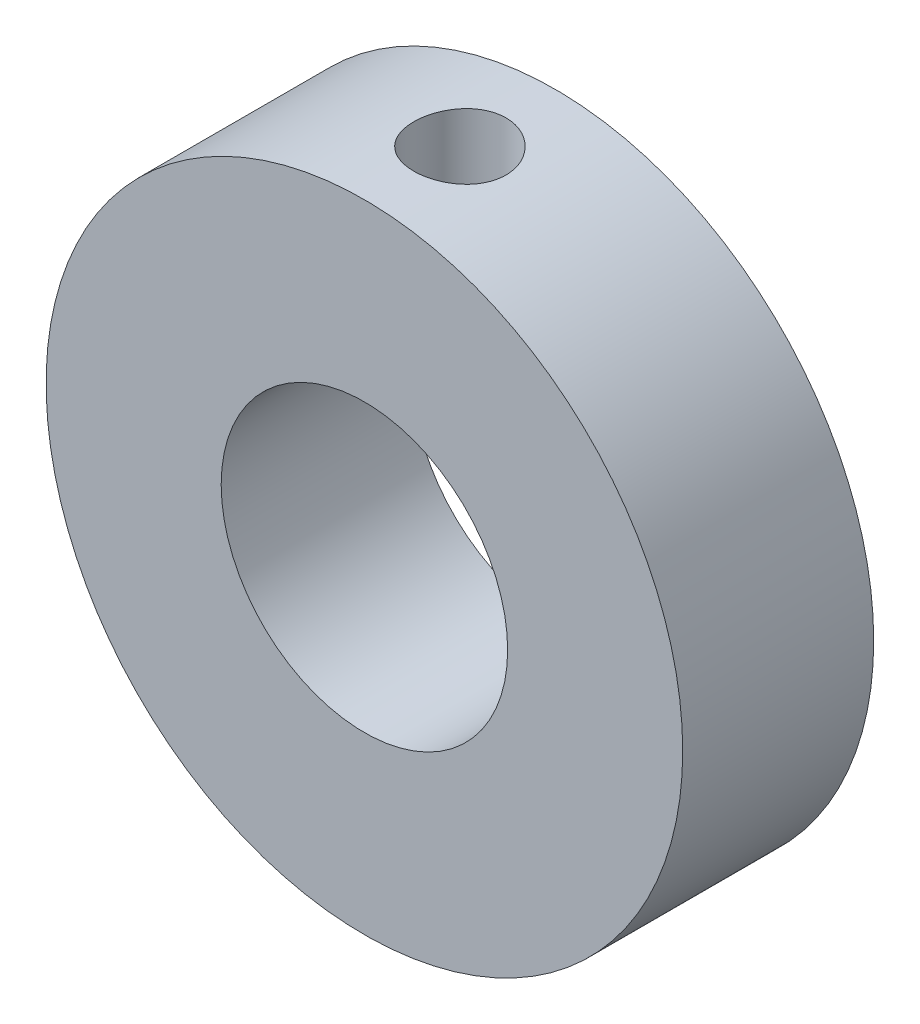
from build123d import *

# Parameters (mm, degrees)
ESQUISSE1_R      = 10
ESQUISSE1_R_2    = 4.5
EXTRUSION1_DEPTH = 6
ESQUISSE3_W      = 1.45
ESQUISSE3_H      = 10


with BuildPart() as part:
    # Esquisse1 → Extrusion1 (new body)
    with BuildSketch(Plane.XY):
        Circle(ESQUISSE1_R)
        Circle(ESQUISSE1_R_2, mode=Mode.SUBTRACT)
    extrude(amount=EXTRUSION1_DEPTH)

    # Esquisse3 → Trou taraud_ M3.5x0.61 (revolve, cut)
    with BuildSketch(Plane(origin=(0, 0, 3), x_dir=(0, 0, -1), z_dir=(1, 0, 0))):
        with Locations((0.725, 5)):
            Rectangle(ESQUISSE3_W, ESQUISSE3_H)
    revolve(axis=Axis((0, -6.35, 3), (0, 1, 0)), mode=Mode.SUBTRACT)


solid = part.part
